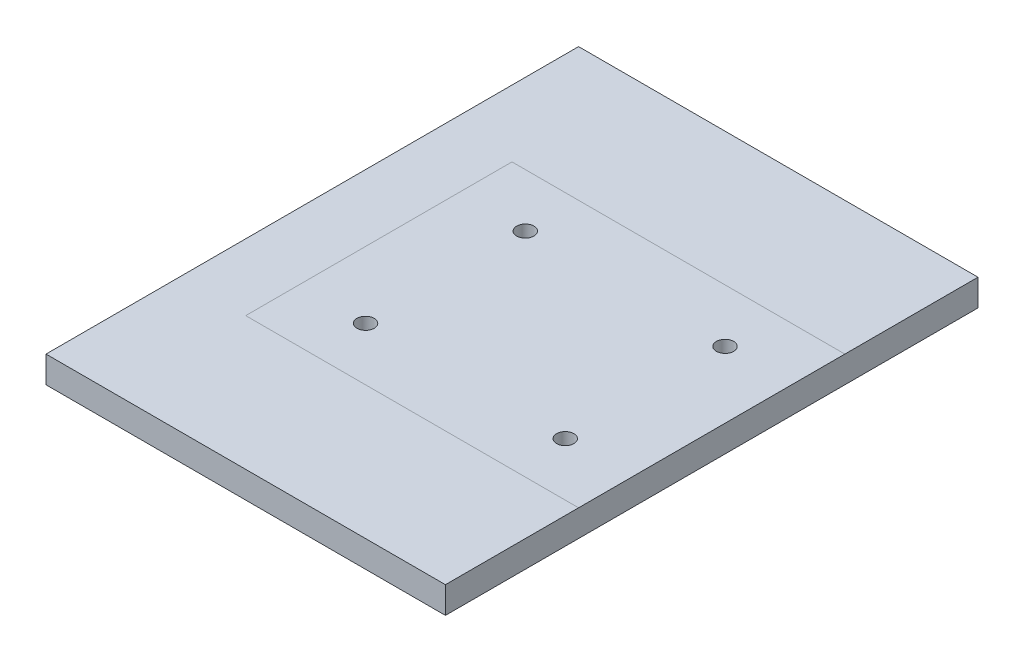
from build123d import *

# Parameters (mm, degrees)
SKETCH1_W           = 300
SKETCH1_H           = 400
SUPPORT_PLATE_DEPTH = 20
SKETCH2_R           = 6.5
BOLT_HOLES_DEPTH    = 251.79872408


with BuildPart() as part:
    # Sketch1 → Support Plate (new body)
    with BuildSketch(Plane(origin=(0, 0, 0), x_dir=(1, 0, 0), z_dir=(0, 1, 0))):
        Rectangle(SKETCH1_W, SKETCH1_H)
    extrude(amount=-SUPPORT_PLATE_DEPTH)

    # Sketch2 → Bolt Holes (cut, through all)
    with BuildSketch(Plane(origin=(0, 0, 0), x_dir=(-1, 0, 0), z_dir=(0, 1, 0))):
        with Locations(Location((-100, -60, 0), (0, 0, 90))):
            Circle(SKETCH2_R)
        with Locations(Location((50, -60, 0), (0, 0, 90))):
            Circle(SKETCH2_R)
        with Locations(Location((50, 60, 0), (0, 0, 90))):
            Circle(SKETCH2_R)
        with Locations(Location((-100, 60, 0), (0, 0, 90))):
            Circle(SKETCH2_R)
    extrude(amount=-BOLT_HOLES_DEPTH, mode=Mode.SUBTRACT)


solid = part.part
